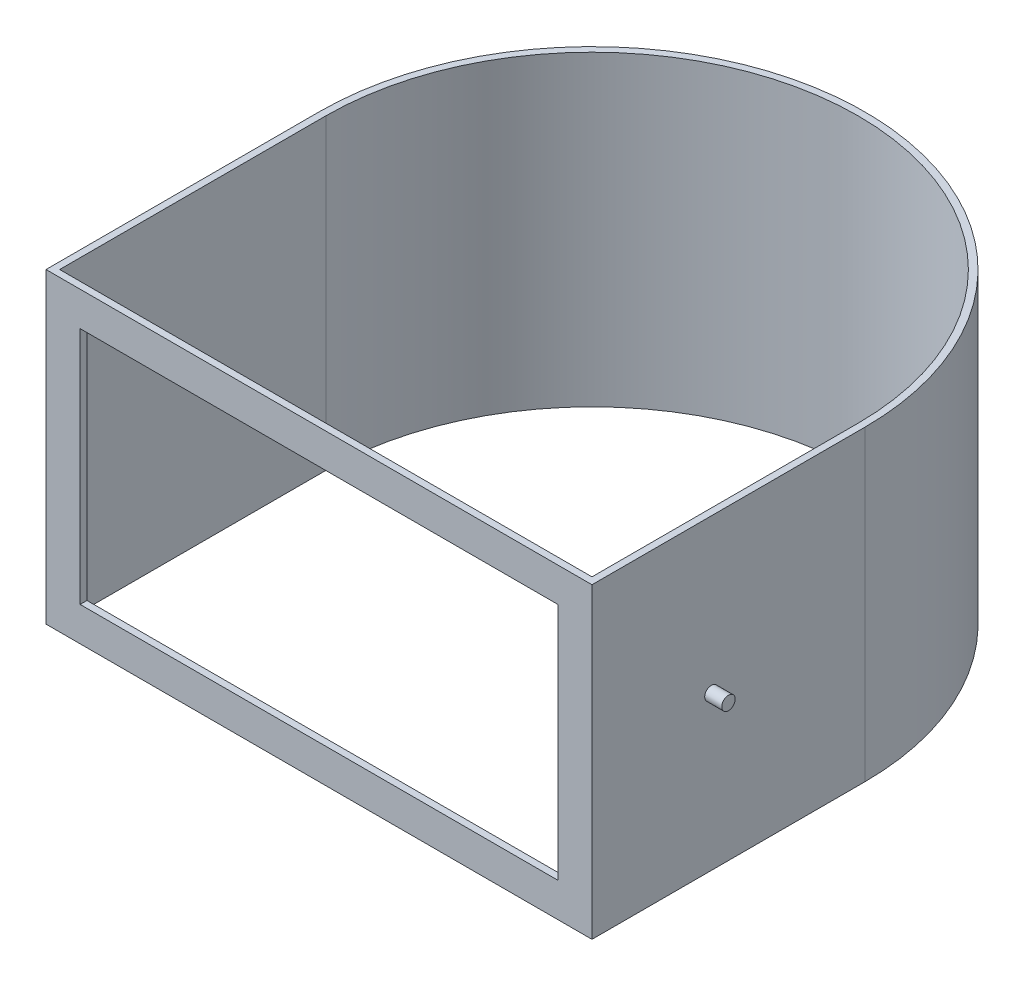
ISO-10303-21;
HEADER;
FILE_DESCRIPTION(('STEP AP214'),'2;1');
FILE_NAME('part.step','',(''),(''),'','','');
FILE_SCHEMA(('AUTOMOTIVE_DESIGN { 1 0 10303 214 1 1 1 1 }'));
ENDSEC;
DATA;
#1=APPLICATION_CONTEXT('core data for automotive mechanical design processes');
#2=APPLICATION_PROTOCOL_DEFINITION('international standard','automotive_design',2000,#1);
#3=PRODUCT_CONTEXT('',#1,'mechanical');
#4=PRODUCT('Part','Part','',(#3));
#5=PRODUCT_RELATED_PRODUCT_CATEGORY('part','',(#4));
#6=PRODUCT_DEFINITION_FORMATION('','',#4);
#7=PRODUCT_DEFINITION_CONTEXT('part definition',#1,'design');
#8=PRODUCT_DEFINITION('design','',#6,#7);
#9=PRODUCT_DEFINITION_SHAPE('','',#8);
#10=(LENGTH_UNIT() NAMED_UNIT(*) SI_UNIT(.MILLI.,.METRE.));
#11=(NAMED_UNIT(*) PLANE_ANGLE_UNIT() SI_UNIT($,.RADIAN.));
#12=(NAMED_UNIT(*) SI_UNIT($,.STERADIAN.) SOLID_ANGLE_UNIT());
#13=UNCERTAINTY_MEASURE_WITH_UNIT(LENGTH_MEASURE(1.E-05),#10,'distance_accuracy_value','');
#14=(GEOMETRIC_REPRESENTATION_CONTEXT(3) GLOBAL_UNCERTAINTY_ASSIGNED_CONTEXT((#13)) GLOBAL_UNIT_ASSIGNED_CONTEXT((#10,
#11,#12)) REPRESENTATION_CONTEXT('',''));
#15=CARTESIAN_POINT('',(0.,0.,0.));
#16=DIRECTION('',(0.,0.,1.));
#17=DIRECTION('',(1.,0.,0.));
#18=AXIS2_PLACEMENT_3D('',#15,#16,#17);
#19=CARTESIAN_POINT('',(0.,114.3,0.));
#20=DIRECTION('',(0.,-1.,0.));
#21=DIRECTION('',(0.,0.,-1.));
#22=AXIS2_PLACEMENT_3D('',#19,#20,#21);
#23=CYLINDRICAL_SURFACE('',#22,101.6);
#24=CARTESIAN_POINT('',(0.,0.,0.));
#25=DIRECTION('',(0.,1.,0.));
#26=DIRECTION('',(0.,0.,1.));
#27=AXIS2_PLACEMENT_3D('',#24,#25,#26);
#28=CIRCLE('',#27,101.6);
#29=CARTESIAN_POINT('',(101.6,0.,0.));
#30=VERTEX_POINT('',#29);
#31=CARTESIAN_POINT('',(-101.6,0.,0.));
#32=VERTEX_POINT('',#31);
#33=EDGE_CURVE('E308',#30,#32,#28,.T.);
#34=ORIENTED_EDGE('',*,*,#33,.T.);
#35=DIRECTION('',(0.,-1.,0.));
#36=VECTOR('',#35,1.);
#37=CARTESIAN_POINT('',(-101.6,114.3,0.));
#38=LINE('',#37,#36);
#39=CARTESIAN_POINT('',(-101.6,114.3,0.));
#40=VERTEX_POINT('',#39);
#41=EDGE_CURVE('E80',#40,#32,#38,.T.);
#42=ORIENTED_EDGE('',*,*,#41,.F.);
#43=CARTESIAN_POINT('',(0.,114.3,0.));
#44=DIRECTION('',(0.,1.,0.));
#45=DIRECTION('',(0.,0.,1.));
#46=AXIS2_PLACEMENT_3D('',#43,#44,#45);
#47=CIRCLE('',#46,101.6);
#48=CARTESIAN_POINT('',(101.6,114.3,0.));
#49=VERTEX_POINT('',#48);
#50=EDGE_CURVE('E337',#49,#40,#47,.T.);
#51=ORIENTED_EDGE('',*,*,#50,.F.);
#52=DIRECTION('',(0.,-1.,0.));
#53=VECTOR('',#52,1.);
#54=CARTESIAN_POINT('',(101.6,114.3,0.));
#55=LINE('',#54,#53);
#56=EDGE_CURVE('E313',#49,#30,#55,.T.);
#57=ORIENTED_EDGE('',*,*,#56,.T.);
#58=EDGE_LOOP('',(#34,#42,#51,#57));
#59=FACE_BOUND('',#58,.T.);
#60=CARTESIAN_POINT('',(2.5,57.15,-101.569237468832));
#61=CARTESIAN_POINT('',(2.49999378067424,57.0095967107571,-101.569237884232));
#62=CARTESIAN_POINT('',(2.48813245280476,56.8690921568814,-101.56953172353));
#63=CARTESIAN_POINT('',(2.4409807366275,56.591954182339,-101.570675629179));
#64=CARTESIAN_POINT('',(2.4056622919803,56.4553256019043,-101.571526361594));
#65=CARTESIAN_POINT('',(2.31260379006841,56.1899946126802,-101.573687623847));
#66=CARTESIAN_POINT('',(2.25487461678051,56.0612883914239,-101.574997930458));
#67=CARTESIAN_POINT('',(2.11864877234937,55.8154301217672,-101.577930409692));
#68=CARTESIAN_POINT('',(2.04015720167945,55.6982752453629,-101.579552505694));
#69=CARTESIAN_POINT('',(1.86460121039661,55.478767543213,-101.582926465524));
#70=CARTESIAN_POINT('',(1.76753134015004,55.3764190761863,-101.584678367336));
#71=CARTESIAN_POINT('',(1.55758293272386,55.1894658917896,-101.588114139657));
#72=CARTESIAN_POINT('',(1.44470376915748,55.1048618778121,-101.589798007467));
#73=CARTESIAN_POINT('',(1.20632850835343,54.9557952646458,-101.592908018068));
#74=CARTESIAN_POINT('',(1.08083104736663,54.8913348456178,-101.594334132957));
#75=CARTESIAN_POINT('',(0.82079141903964,54.7843995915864,-101.596767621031));
#76=CARTESIAN_POINT('',(0.686249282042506,54.7419246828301,-101.597774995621));
#77=CARTESIAN_POINT('',(0.411968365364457,54.6801743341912,-101.59925726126));
#78=CARTESIAN_POINT('',(0.272230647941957,54.6608941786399,-101.599732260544));
#79=CARTESIAN_POINT('',(-0.00849872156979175,54.6460661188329,-101.600096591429));
#80=CARTESIAN_POINT('',(-0.149490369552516,54.6505181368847,-101.599985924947));
#81=CARTESIAN_POINT('',(-0.428693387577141,54.6830240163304,-101.599191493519));
#82=CARTESIAN_POINT('',(-0.56690535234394,54.7110727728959,-101.598507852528));
#83=CARTESIAN_POINT('',(-0.836658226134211,54.7899680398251,-101.596644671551));
#84=CARTESIAN_POINT('',(-0.96819912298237,54.8408145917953,-101.59546513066));
#85=CARTESIAN_POINT('',(-1.22089222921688,54.9638679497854,-101.592742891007));
#86=CARTESIAN_POINT('',(-1.34204329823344,55.0360770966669,-101.59120015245));
#87=CARTESIAN_POINT('',(-1.57050515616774,55.1998041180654,-101.587925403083));
#88=CARTESIAN_POINT('',(-1.67781592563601,55.2913220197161,-101.586193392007));
#89=CARTESIAN_POINT('',(-1.87558079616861,55.4910975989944,-101.582734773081));
#90=CARTESIAN_POINT('',(-1.96603041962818,55.5993597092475,-101.581008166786));
#91=CARTESIAN_POINT('',(-2.12747097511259,55.8295348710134,-101.577755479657));
#92=CARTESIAN_POINT('',(-2.19846190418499,55.9514479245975,-101.576229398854));
#93=CARTESIAN_POINT('',(-2.31896936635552,56.2054667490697,-101.573549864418));
#94=CARTESIAN_POINT('',(-2.368485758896,56.3375725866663,-101.572396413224));
#95=CARTESIAN_POINT('',(-2.44463568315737,56.6082258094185,-101.570592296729));
#96=CARTESIAN_POINT('',(-2.47126925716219,56.7467731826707,-101.5699416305));
#97=CARTESIAN_POINT('',(-2.50089202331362,57.0263376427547,-101.569216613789));
#98=CARTESIAN_POINT('',(-2.50388741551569,57.167354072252,-101.569142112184));
#99=CARTESIAN_POINT('',(-2.48616494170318,57.4478878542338,-101.569577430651));
#100=CARTESIAN_POINT('',(-2.46544709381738,57.5874052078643,-101.570087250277));
#101=CARTESIAN_POINT('',(-2.40089138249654,57.8609631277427,-101.571633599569));
#102=CARTESIAN_POINT('',(-2.35705633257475,57.9950043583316,-101.572670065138));
#103=CARTESIAN_POINT('',(-2.24751340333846,58.2538254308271,-101.575152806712));
#104=CARTESIAN_POINT('',(-2.18180549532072,58.3786052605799,-101.576599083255));
#105=CARTESIAN_POINT('',(-2.03036608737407,58.6153900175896,-101.579738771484));
#106=CARTESIAN_POINT('',(-1.94463041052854,58.7273922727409,-101.581432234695));
#107=CARTESIAN_POINT('',(-1.7555753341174,58.9354156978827,-101.584875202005));
#108=CARTESIAN_POINT('',(-1.6522559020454,59.0314368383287,-101.586624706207));
#109=CARTESIAN_POINT('',(-1.43093966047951,59.2047929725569,-101.589982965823));
#110=CARTESIAN_POINT('',(-1.31293971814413,59.2821239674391,-101.591591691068));
#111=CARTESIAN_POINT('',(-1.06562812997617,59.415877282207,-101.594486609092));
#112=CARTESIAN_POINT('',(-0.936316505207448,59.4722996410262,-101.59577280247));
#113=CARTESIAN_POINT('',(-0.670067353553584,59.5626270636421,-101.597877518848));
#114=CARTESIAN_POINT('',(-0.533130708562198,59.5965347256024,-101.598696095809));
#115=CARTESIAN_POINT('',(-0.2555060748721,59.6408787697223,-101.599773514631));
#116=CARTESIAN_POINT('',(-0.114818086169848,59.6513151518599,-101.600032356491));
#117=CARTESIAN_POINT('',(0.166275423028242,59.6484200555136,-101.599961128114));
#118=CARTESIAN_POINT('',(0.306681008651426,59.6350948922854,-101.599631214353));
#119=CARTESIAN_POINT('',(0.583261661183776,59.5850679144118,-101.598419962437));
#120=CARTESIAN_POINT('',(0.719436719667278,59.5483660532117,-101.597538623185));
#121=CARTESIAN_POINT('',(0.983693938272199,59.4526280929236,-101.595323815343));
#122=CARTESIAN_POINT('',(1.11177595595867,59.3935916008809,-101.593990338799));
#123=CARTESIAN_POINT('',(1.35620716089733,59.2548632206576,-101.591021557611));
#124=CARTESIAN_POINT('',(1.47255678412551,59.1751721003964,-101.589386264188));
#125=CARTESIAN_POINT('',(1.69024750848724,58.9973811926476,-101.585997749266));
#126=CARTESIAN_POINT('',(1.79158621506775,58.8992784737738,-101.584244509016));
#127=CARTESIAN_POINT('',(1.97638253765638,58.6874237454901,-101.58081747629));
#128=CARTESIAN_POINT('',(2.05983571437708,58.5736678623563,-101.579143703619));
#129=CARTESIAN_POINT('',(2.20650174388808,58.3336995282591,-101.576063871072));
#130=CARTESIAN_POINT('',(2.26970258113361,58.207479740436,-101.574657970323));
#131=CARTESIAN_POINT('',(2.37394291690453,57.9463154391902,-101.572275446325));
#132=CARTESIAN_POINT('',(2.41500888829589,57.8113815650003,-101.571298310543));
#133=CARTESIAN_POINT('',(2.4629105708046,57.5879940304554,-101.570145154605));
#134=CARTESIAN_POINT('',(2.47680165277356,57.5009908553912,-101.569806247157));
#135=CARTESIAN_POINT('',(2.49534831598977,57.3260050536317,-101.569352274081));
#136=CARTESIAN_POINT('',(2.50000389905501,57.238022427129,-101.569237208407));
#137=CARTESIAN_POINT('',(2.5,57.15,-101.569237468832));
#138=B_SPLINE_CURVE_WITH_KNOTS('',3,(#60,#61,#62,#63,#64,#65,#66,#67,#68,#69,#70,#71,#72,#73,
#74,#75,#76,#77,#78,#79,#80,#81,#82,#83,#84,#85,#86,#87,#88,#89,#90,#91,#92,#93,#94,#95,#96,#97,
#98,#99,#100,#101,#102,#103,#104,#105,#106,#107,#108,#109,#110,#111,#112,#113,#114,#115,#116,
#117,#118,#119,#120,#121,#122,#123,#124,#125,#126,#127,#128,#129,#130,#131,#132,#133,#134,#135,
#136,#137),.UNSPECIFIED.,.T.,.F.,(4,2,2,2,2,2,2,2,2,2,2,2,2,2,2,2,2,2,2,2,2,2,2,2,2,2,2,2,2,2,2,
2,2,2,2,2,2,2,4),(0.,0.420888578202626,0.842281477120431,1.26346997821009,1.68455510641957,
2.10576394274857,2.5269894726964,2.94826057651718,3.36953026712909,3.79071429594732,
4.21189694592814,4.63298850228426,5.0540808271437,5.47521931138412,5.89635838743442,
6.31760914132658,6.73885995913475,7.16011353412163,7.58136633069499,8.00250863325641,
8.42365061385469,8.84474135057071,9.26583263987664,9.68701182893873,10.1081917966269,
10.5294617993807,10.9507310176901,11.3719516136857,11.7931722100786,12.2142808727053,
12.6353903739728,13.0565072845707,13.4776085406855,13.8987768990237,14.320049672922,
14.7415719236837,15.162588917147,15.4264548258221,15.6903206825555),.UNSPECIFIED.);
#139=CARTESIAN_POINT('',(2.5,57.15,-101.569237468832));
#140=VERTEX_POINT('',#139);
#141=EDGE_CURVE('E12',#140,#140,#138,.T.);
#142=ORIENTED_EDGE('',*,*,#141,.F.);
#143=EDGE_LOOP('',(#142));
#144=FACE_BOUND('',#143,.T.);
#145=ADVANCED_FACE('F76',(#59,#144),#23,.T.);
#146=CARTESIAN_POINT('',(0.,114.3,0.));
#147=DIRECTION('',(0.,-1.,0.));
#148=DIRECTION('',(0.,0.,-1.));
#149=AXIS2_PLACEMENT_3D('',#146,#147,#148);
#150=CYLINDRICAL_SURFACE('',#149,99.06);
#151=DIRECTION('',(0.,1.,0.));
#152=VECTOR('',#151,1.);
#153=CARTESIAN_POINT('',(-99.06,114.3,0.));
#154=LINE('',#153,#152);
#155=CARTESIAN_POINT('',(-99.06,114.3,0.));
#156=VERTEX_POINT('',#155);
#157=CARTESIAN_POINT('',(-99.06,0.,0.));
#158=VERTEX_POINT('',#157);
#159=EDGE_CURVE('E319',#156,#158,#154,.F.);
#160=ORIENTED_EDGE('',*,*,#159,.T.);
#161=CARTESIAN_POINT('',(0.,0.,0.));
#162=DIRECTION('',(0.,1.,0.));
#163=DIRECTION('',(0.,0.,1.));
#164=AXIS2_PLACEMENT_3D('',#161,#162,#163);
#165=CIRCLE('',#164,99.06);
#166=CARTESIAN_POINT('',(99.06,0.,0.));
#167=VERTEX_POINT('',#166);
#168=EDGE_CURVE('E217',#167,#158,#165,.T.);
#169=ORIENTED_EDGE('',*,*,#168,.F.);
#170=DIRECTION('',(0.,-1.,0.));
#171=VECTOR('',#170,1.);
#172=CARTESIAN_POINT('',(99.06,114.3,0.));
#173=LINE('',#172,#171);
#174=CARTESIAN_POINT('',(99.06,114.3,0.));
#175=VERTEX_POINT('',#174);
#176=EDGE_CURVE('E360',#175,#167,#173,.T.);
#177=ORIENTED_EDGE('',*,*,#176,.F.);
#178=CARTESIAN_POINT('',(0.,114.3,0.));
#179=DIRECTION('',(0.,1.,0.));
#180=DIRECTION('',(0.,0.,1.));
#181=AXIS2_PLACEMENT_3D('',#178,#179,#180);
#182=CIRCLE('',#181,99.06);
#183=EDGE_CURVE('E358',#175,#156,#182,.T.);
#184=ORIENTED_EDGE('',*,*,#183,.T.);
#185=EDGE_LOOP('',(#160,#169,#177,#184));
#186=FACE_BOUND('',#185,.T.);
#187=ADVANCED_FACE('F264',(#186),#150,.F.);
#188=CARTESIAN_POINT('',(-101.6,114.3,0.));
#189=DIRECTION('',(1.,0.,0.));
#190=DIRECTION('',(0.,0.,-1.));
#191=AXIS2_PLACEMENT_3D('',#188,#189,#190);
#192=PLANE('',#191);
#193=CARTESIAN_POINT('',(-101.6,57.15,57.15));
#194=DIRECTION('',(1.,0.,0.));
#195=DIRECTION('',(0.,0.,-1.));
#196=AXIS2_PLACEMENT_3D('',#193,#194,#195);
#197=CIRCLE('',#196,2.5);
#198=CARTESIAN_POINT('',(-101.6,57.15,54.65));
#199=VERTEX_POINT('',#198);
#200=EDGE_CURVE('E356',#199,#199,#197,.T.);
#201=ORIENTED_EDGE('',*,*,#200,.T.);
#202=EDGE_LOOP('',(#201));
#203=FACE_BOUND('',#202,.T.);
#204=DIRECTION('',(0.,0.,1.));
#205=VECTOR('',#204,1.);
#206=CARTESIAN_POINT('',(-101.6,0.,0.));
#207=LINE('',#206,#205);
#208=CARTESIAN_POINT('',(-101.6,0.,101.6));
#209=VERTEX_POINT('',#208);
#210=EDGE_CURVE('E318',#32,#209,#207,.T.);
#211=ORIENTED_EDGE('',*,*,#210,.T.);
#212=DIRECTION('',(0.,-1.,0.));
#213=VECTOR('',#212,1.);
#214=CARTESIAN_POINT('',(-101.6,114.3,101.6));
#215=LINE('',#214,#213);
#216=CARTESIAN_POINT('',(-101.6,114.3,101.6));
#217=VERTEX_POINT('',#216);
#218=EDGE_CURVE('E342',#217,#209,#215,.T.);
#219=ORIENTED_EDGE('',*,*,#218,.F.);
#220=DIRECTION('',(0.,0.,1.));
#221=VECTOR('',#220,1.);
#222=CARTESIAN_POINT('',(-101.6,114.3,0.));
#223=LINE('',#222,#221);
#224=EDGE_CURVE('E384',#40,#217,#223,.T.);
#225=ORIENTED_EDGE('',*,*,#224,.F.);
#226=ORIENTED_EDGE('',*,*,#41,.T.);
#227=EDGE_LOOP('',(#211,#219,#225,#226));
#228=FACE_BOUND('',#227,.T.);
#229=ADVANCED_FACE('F267',(#203,#228),#192,.F.);
#230=CARTESIAN_POINT('',(0.,114.3,101.6));
#231=DIRECTION('',(0.,0.,-1.));
#232=DIRECTION('',(-1.,0.,0.));
#233=AXIS2_PLACEMENT_3D('',#230,#231,#232);
#234=PLANE('',#233);
#235=DIRECTION('',(-1.,0.,0.));
#236=VECTOR('',#235,1.);
#237=CARTESIAN_POINT('',(-88.9,101.6,101.6));
#238=LINE('',#237,#236);
#239=CARTESIAN_POINT('',(88.9,101.6,101.6));
#240=VERTEX_POINT('',#239);
#241=CARTESIAN_POINT('',(-88.9,101.6,101.6));
#242=VERTEX_POINT('',#241);
#243=EDGE_CURVE('E202',#240,#242,#238,.T.);
#244=ORIENTED_EDGE('',*,*,#243,.F.);
#245=DIRECTION('',(0.,1.,0.));
#246=VECTOR('',#245,1.);
#247=CARTESIAN_POINT('',(88.9,12.7,101.6));
#248=LINE('',#247,#246);
#249=CARTESIAN_POINT('',(88.9,12.7,101.6));
#250=VERTEX_POINT('',#249);
#251=EDGE_CURVE('E94',#250,#240,#248,.T.);
#252=ORIENTED_EDGE('',*,*,#251,.F.);
#253=DIRECTION('',(1.,0.,0.));
#254=VECTOR('',#253,1.);
#255=CARTESIAN_POINT('',(-88.9,12.7,101.6));
#256=LINE('',#255,#254);
#257=CARTESIAN_POINT('',(-88.9,12.7,101.6));
#258=VERTEX_POINT('',#257);
#259=EDGE_CURVE('E189',#258,#250,#256,.T.);
#260=ORIENTED_EDGE('',*,*,#259,.F.);
#261=DIRECTION('',(0.,-1.,0.));
#262=VECTOR('',#261,1.);
#263=CARTESIAN_POINT('',(-88.9,12.7,101.6));
#264=LINE('',#263,#262);
#265=EDGE_CURVE('E193',#242,#258,#264,.T.);
#266=ORIENTED_EDGE('',*,*,#265,.F.);
#267=EDGE_LOOP('',(#244,#252,#260,#266));
#268=FACE_BOUND('',#267,.T.);
#269=DIRECTION('',(1.,0.,0.));
#270=VECTOR('',#269,1.);
#271=CARTESIAN_POINT('',(0.,0.,101.6));
#272=LINE('',#271,#270);
#273=CARTESIAN_POINT('',(101.6,0.,101.6));
#274=VERTEX_POINT('',#273);
#275=EDGE_CURVE('E323',#209,#274,#272,.T.);
#276=ORIENTED_EDGE('',*,*,#275,.T.);
#277=DIRECTION('',(0.,-1.,0.));
#278=VECTOR('',#277,1.);
#279=CARTESIAN_POINT('',(101.6,114.3,101.6));
#280=LINE('',#279,#278);
#281=CARTESIAN_POINT('',(101.6,114.3,101.6));
#282=VERTEX_POINT('',#281);
#283=EDGE_CURVE('E340',#282,#274,#280,.T.);
#284=ORIENTED_EDGE('',*,*,#283,.F.);
#285=DIRECTION('',(1.,0.,0.));
#286=VECTOR('',#285,1.);
#287=CARTESIAN_POINT('',(0.,114.3,101.6));
#288=LINE('',#287,#286);
#289=EDGE_CURVE('E386',#217,#282,#288,.T.);
#290=ORIENTED_EDGE('',*,*,#289,.F.);
#291=ORIENTED_EDGE('',*,*,#218,.T.);
#292=EDGE_LOOP('',(#276,#284,#290,#291));
#293=FACE_BOUND('',#292,.T.);
#294=ADVANCED_FACE('F289',(#268,#293),#234,.F.);
#295=CARTESIAN_POINT('',(101.6,114.3,0.));
#296=DIRECTION('',(1.,0.,0.));
#297=DIRECTION('',(0.,0.,-1.));
#298=AXIS2_PLACEMENT_3D('',#295,#296,#297);
#299=PLANE('',#298);
#300=CARTESIAN_POINT('',(101.6,57.15,57.15));
#301=DIRECTION('',(1.,0.,0.));
#302=DIRECTION('',(0.,0.,-1.));
#303=AXIS2_PLACEMENT_3D('',#300,#301,#302);
#304=CIRCLE('',#303,2.5);
#305=CARTESIAN_POINT('',(101.6,57.15,54.65));
#306=VERTEX_POINT('',#305);
#307=EDGE_CURVE('E86',#306,#306,#304,.T.);
#308=ORIENTED_EDGE('',*,*,#307,.F.);
#309=EDGE_LOOP('',(#308));
#310=FACE_BOUND('',#309,.T.);
#311=DIRECTION('',(0.,0.,1.));
#312=VECTOR('',#311,1.);
#313=CARTESIAN_POINT('',(101.6,0.,0.));
#314=LINE('',#313,#312);
#315=EDGE_CURVE('E334',#30,#274,#314,.T.);
#316=ORIENTED_EDGE('',*,*,#315,.F.);
#317=ORIENTED_EDGE('',*,*,#56,.F.);
#318=DIRECTION('',(0.,0.,1.));
#319=VECTOR('',#318,1.);
#320=CARTESIAN_POINT('',(101.6,114.3,0.));
#321=LINE('',#320,#319);
#322=EDGE_CURVE('E328',#49,#282,#321,.T.);
#323=ORIENTED_EDGE('',*,*,#322,.T.);
#324=ORIENTED_EDGE('',*,*,#283,.T.);
#325=EDGE_LOOP('',(#316,#317,#323,#324));
#326=FACE_BOUND('',#325,.T.);
#327=ADVANCED_FACE('F282',(#310,#326),#299,.T.);
#328=CARTESIAN_POINT('',(0.,114.3,0.));
#329=DIRECTION('',(0.,1.,0.));
#330=DIRECTION('',(0.,0.,1.));
#331=AXIS2_PLACEMENT_3D('',#328,#329,#330);
#332=PLANE('',#331);
#333=ORIENTED_EDGE('',*,*,#183,.F.);
#334=DIRECTION('',(0.,0.,1.));
#335=VECTOR('',#334,1.);
#336=CARTESIAN_POINT('',(99.06,114.3,0.));
#337=LINE('',#336,#335);
#338=CARTESIAN_POINT('',(99.06,114.3,99.06));
#339=VERTEX_POINT('',#338);
#340=EDGE_CURVE('E364',#175,#339,#337,.T.);
#341=ORIENTED_EDGE('',*,*,#340,.T.);
#342=DIRECTION('',(1.,0.,0.));
#343=VECTOR('',#342,1.);
#344=CARTESIAN_POINT('',(0.,114.3,99.06));
#345=LINE('',#344,#343);
#346=CARTESIAN_POINT('',(-99.06,114.3,99.06));
#347=VERTEX_POINT('',#346);
#348=EDGE_CURVE('E374',#347,#339,#345,.T.);
#349=ORIENTED_EDGE('',*,*,#348,.F.);
#350=DIRECTION('',(0.,0.,1.));
#351=VECTOR('',#350,1.);
#352=CARTESIAN_POINT('',(-99.06,114.3,0.));
#353=LINE('',#352,#351);
#354=EDGE_CURVE('E371',#156,#347,#353,.T.);
#355=ORIENTED_EDGE('',*,*,#354,.F.);
#356=EDGE_LOOP('',(#333,#341,#349,#355));
#357=FACE_BOUND('',#356,.T.);
#358=ORIENTED_EDGE('',*,*,#50,.T.);
#359=ORIENTED_EDGE('',*,*,#224,.T.);
#360=ORIENTED_EDGE('',*,*,#289,.T.);
#361=ORIENTED_EDGE('',*,*,#322,.F.);
#362=EDGE_LOOP('',(#358,#359,#360,#361));
#363=FACE_BOUND('',#362,.T.);
#364=ADVANCED_FACE('F279',(#357,#363),#332,.T.);
#365=CARTESIAN_POINT('',(0.,0.,0.));
#366=DIRECTION('',(0.,1.,0.));
#367=DIRECTION('',(0.,0.,1.));
#368=AXIS2_PLACEMENT_3D('',#365,#366,#367);
#369=PLANE('',#368);
#370=DIRECTION('',(0.,0.,-1.));
#371=VECTOR('',#370,1.);
#372=CARTESIAN_POINT('',(99.06,0.,99.06));
#373=LINE('',#372,#371);
#374=CARTESIAN_POINT('',(99.06,0.,99.06));
#375=VERTEX_POINT('',#374);
#376=EDGE_CURVE('E211',#375,#167,#373,.T.);
#377=ORIENTED_EDGE('',*,*,#376,.T.);
#378=ORIENTED_EDGE('',*,*,#168,.T.);
#379=DIRECTION('',(0.,0.,-1.));
#380=VECTOR('',#379,1.);
#381=CARTESIAN_POINT('',(-99.06,0.,99.06));
#382=LINE('',#381,#380);
#383=CARTESIAN_POINT('',(-99.06,0.,99.06));
#384=VERTEX_POINT('',#383);
#385=EDGE_CURVE('E222',#384,#158,#382,.T.);
#386=ORIENTED_EDGE('',*,*,#385,.F.);
#387=DIRECTION('',(1.,0.,0.));
#388=VECTOR('',#387,1.);
#389=CARTESIAN_POINT('',(-99.06,0.,99.06));
#390=LINE('',#389,#388);
#391=EDGE_CURVE('E226',#384,#375,#390,.T.);
#392=ORIENTED_EDGE('',*,*,#391,.T.);
#393=EDGE_LOOP('',(#377,#378,#386,#392));
#394=FACE_BOUND('',#393,.T.);
#395=ORIENTED_EDGE('',*,*,#33,.F.);
#396=ORIENTED_EDGE('',*,*,#315,.T.);
#397=ORIENTED_EDGE('',*,*,#275,.F.);
#398=ORIENTED_EDGE('',*,*,#210,.F.);
#399=EDGE_LOOP('',(#395,#396,#397,#398));
#400=FACE_BOUND('',#399,.T.);
#401=ADVANCED_FACE('F272',(#394,#400),#369,.F.);
#402=CARTESIAN_POINT('',(-99.06,114.3,0.));
#403=DIRECTION('',(1.,0.,0.));
#404=DIRECTION('',(0.,0.,-1.));
#405=AXIS2_PLACEMENT_3D('',#402,#403,#404);
#406=PLANE('',#405);
#407=DIRECTION('',(0.,-1.,0.));
#408=VECTOR('',#407,1.);
#409=CARTESIAN_POINT('',(-99.06,114.3,99.06));
#410=LINE('',#409,#408);
#411=EDGE_CURVE('E325',#347,#384,#410,.T.);
#412=ORIENTED_EDGE('',*,*,#411,.T.);
#413=ORIENTED_EDGE('',*,*,#385,.T.);
#414=ORIENTED_EDGE('',*,*,#159,.F.);
#415=ORIENTED_EDGE('',*,*,#354,.T.);
#416=EDGE_LOOP('',(#412,#413,#414,#415));
#417=FACE_BOUND('',#416,.T.);
#418=ADVANCED_FACE('F269',(#417),#406,.T.);
#419=CARTESIAN_POINT('',(0.,114.3,99.06));
#420=DIRECTION('',(0.,0.,-1.));
#421=DIRECTION('',(-1.,0.,0.));
#422=AXIS2_PLACEMENT_3D('',#419,#420,#421);
#423=PLANE('',#422);
#424=DIRECTION('',(0.,1.,0.));
#425=VECTOR('',#424,1.);
#426=CARTESIAN_POINT('',(88.9,12.7,99.06));
#427=LINE('',#426,#425);
#428=CARTESIAN_POINT('',(88.9,12.7,99.06));
#429=VERTEX_POINT('',#428);
#430=CARTESIAN_POINT('',(88.9,101.6,99.06));
#431=VERTEX_POINT('',#430);
#432=EDGE_CURVE('E170',#429,#431,#427,.T.);
#433=ORIENTED_EDGE('',*,*,#432,.T.);
#434=DIRECTION('',(-1.,0.,0.));
#435=VECTOR('',#434,1.);
#436=CARTESIAN_POINT('',(-88.9,101.6,99.06));
#437=LINE('',#436,#435);
#438=CARTESIAN_POINT('',(-88.9,101.6,99.06));
#439=VERTEX_POINT('',#438);
#440=EDGE_CURVE('E180',#431,#439,#437,.T.);
#441=ORIENTED_EDGE('',*,*,#440,.T.);
#442=DIRECTION('',(0.,-1.,0.));
#443=VECTOR('',#442,1.);
#444=CARTESIAN_POINT('',(-88.9,12.7,99.06));
#445=LINE('',#444,#443);
#446=CARTESIAN_POINT('',(-88.9,12.7,99.06));
#447=VERTEX_POINT('',#446);
#448=EDGE_CURVE('E102',#439,#447,#445,.T.);
#449=ORIENTED_EDGE('',*,*,#448,.T.);
#450=DIRECTION('',(1.,0.,0.));
#451=VECTOR('',#450,1.);
#452=CARTESIAN_POINT('',(-88.9,12.7,99.06));
#453=LINE('',#452,#451);
#454=EDGE_CURVE('E177',#447,#429,#453,.T.);
#455=ORIENTED_EDGE('',*,*,#454,.T.);
#456=EDGE_LOOP('',(#433,#441,#449,#455));
#457=FACE_BOUND('',#456,.T.);
#458=DIRECTION('',(0.,-1.,0.));
#459=VECTOR('',#458,1.);
#460=CARTESIAN_POINT('',(99.06,114.3,99.06));
#461=LINE('',#460,#459);
#462=EDGE_CURVE('E363',#339,#375,#461,.T.);
#463=ORIENTED_EDGE('',*,*,#462,.T.);
#464=ORIENTED_EDGE('',*,*,#391,.F.);
#465=ORIENTED_EDGE('',*,*,#411,.F.);
#466=ORIENTED_EDGE('',*,*,#348,.T.);
#467=EDGE_LOOP('',(#463,#464,#465,#466));
#468=FACE_BOUND('',#467,.T.);
#469=ADVANCED_FACE('F185',(#457,#468),#423,.T.);
#470=CARTESIAN_POINT('',(99.06,114.3,0.));
#471=DIRECTION('',(1.,0.,0.));
#472=DIRECTION('',(0.,0.,-1.));
#473=AXIS2_PLACEMENT_3D('',#470,#471,#472);
#474=PLANE('',#473);
#475=ORIENTED_EDGE('',*,*,#176,.T.);
#476=ORIENTED_EDGE('',*,*,#376,.F.);
#477=ORIENTED_EDGE('',*,*,#462,.F.);
#478=ORIENTED_EDGE('',*,*,#340,.F.);
#479=EDGE_LOOP('',(#475,#476,#477,#478));
#480=FACE_BOUND('',#479,.T.);
#481=ADVANCED_FACE('F255',(#480),#474,.F.);
#482=CARTESIAN_POINT('',(107.95,57.15,57.15));
#483=DIRECTION('',(1.,0.,0.));
#484=DIRECTION('',(0.,0.,-1.));
#485=AXIS2_PLACEMENT_3D('',#482,#483,#484);
#486=PLANE('',#485);
#487=CARTESIAN_POINT('',(107.95,57.15,57.15));
#488=DIRECTION('',(1.,0.,0.));
#489=DIRECTION('',(0.,0.,-1.));
#490=AXIS2_PLACEMENT_3D('',#487,#488,#489);
#491=CIRCLE('',#490,2.5);
#492=CARTESIAN_POINT('',(107.95,57.15,54.65));
#493=VERTEX_POINT('',#492);
#494=EDGE_CURVE('E235',#493,#493,#491,.T.);
#495=ORIENTED_EDGE('',*,*,#494,.T.);
#496=EDGE_LOOP('',(#495));
#497=FACE_BOUND('',#496,.T.);
#498=ADVANCED_FACE('F251',(#497),#486,.T.);
#499=CARTESIAN_POINT('',(-107.95,57.15,57.15));
#500=DIRECTION('',(1.,0.,0.));
#501=DIRECTION('',(0.,0.,-1.));
#502=AXIS2_PLACEMENT_3D('',#499,#500,#501);
#503=CYLINDRICAL_SURFACE('',#502,2.5);
#504=ORIENTED_EDGE('',*,*,#307,.T.);
#505=EDGE_LOOP('',(#504));
#506=FACE_BOUND('',#505,.T.);
#507=ORIENTED_EDGE('',*,*,#494,.F.);
#508=EDGE_LOOP('',(#507));
#509=FACE_BOUND('',#508,.T.);
#510=ADVANCED_FACE('F254',(#506,#509),#503,.T.);
#511=CARTESIAN_POINT('',(-107.95,57.15,57.15));
#512=DIRECTION('',(1.,0.,0.));
#513=DIRECTION('',(0.,0.,-1.));
#514=AXIS2_PLACEMENT_3D('',#511,#512,#513);
#515=CIRCLE('',#514,2.5);
#516=CARTESIAN_POINT('',(-107.95,57.15,54.65));
#517=VERTEX_POINT('',#516);
#518=EDGE_CURVE('E355',#517,#517,#515,.T.);
#519=ORIENTED_EDGE('',*,*,#518,.T.);
#520=EDGE_LOOP('',(#519));
#521=FACE_BOUND('',#520,.T.);
#522=ORIENTED_EDGE('',*,*,#200,.F.);
#523=EDGE_LOOP('',(#522));
#524=FACE_BOUND('',#523,.T.);
#525=ADVANCED_FACE('F259',(#521,#524),#503,.T.);
#526=CARTESIAN_POINT('',(-107.95,57.15,57.15));
#527=DIRECTION('',(1.,0.,0.));
#528=DIRECTION('',(0.,0.,-1.));
#529=AXIS2_PLACEMENT_3D('',#526,#527,#528);
#530=PLANE('',#529);
#531=ORIENTED_EDGE('',*,*,#518,.F.);
#532=EDGE_LOOP('',(#531));
#533=FACE_BOUND('',#532,.T.);
#534=ADVANCED_FACE('F248',(#533),#530,.F.);
#535=CARTESIAN_POINT('',(0.,57.15,-107.95));
#536=DIRECTION('',(0.,0.,1.));
#537=DIRECTION('',(1.,0.,0.));
#538=AXIS2_PLACEMENT_3D('',#535,#536,#537);
#539=CYLINDRICAL_SURFACE('',#538,2.5);
#540=CARTESIAN_POINT('',(0.,57.15,-107.95));
#541=DIRECTION('',(0.,0.,-1.));
#542=DIRECTION('',(-1.,0.,0.));
#543=AXIS2_PLACEMENT_3D('',#540,#541,#542);
#544=CIRCLE('',#543,2.5);
#545=CARTESIAN_POINT('',(-2.5,57.15,-107.95));
#546=VERTEX_POINT('',#545);
#547=EDGE_CURVE('E221',#546,#546,#544,.T.);
#548=ORIENTED_EDGE('',*,*,#547,.F.);
#549=EDGE_LOOP('',(#548));
#550=FACE_BOUND('',#549,.T.);
#551=ORIENTED_EDGE('',*,*,#141,.T.);
#552=EDGE_LOOP('',(#551));
#553=FACE_BOUND('',#552,.T.);
#554=ADVANCED_FACE('F242',(#550,#553),#539,.T.);
#555=CARTESIAN_POINT('',(0.,57.15,-107.95));
#556=DIRECTION('',(0.,0.,-1.));
#557=DIRECTION('',(-1.,0.,0.));
#558=AXIS2_PLACEMENT_3D('',#555,#556,#557);
#559=PLANE('',#558);
#560=ORIENTED_EDGE('',*,*,#547,.T.);
#561=EDGE_LOOP('',(#560));
#562=FACE_BOUND('',#561,.T.);
#563=ADVANCED_FACE('F247',(#562),#559,.T.);
#564=CARTESIAN_POINT('',(88.9,12.7,99.06));
#565=DIRECTION('',(1.,0.,0.));
#566=DIRECTION('',(0.,0.,-1.));
#567=AXIS2_PLACEMENT_3D('',#564,#565,#566);
#568=PLANE('',#567);
#569=ORIENTED_EDGE('',*,*,#251,.T.);
#570=DIRECTION('',(0.,0.,1.));
#571=VECTOR('',#570,1.);
#572=CARTESIAN_POINT('',(88.9,101.6,99.06));
#573=LINE('',#572,#571);
#574=EDGE_CURVE('E166',#431,#240,#573,.T.);
#575=ORIENTED_EDGE('',*,*,#574,.F.);
#576=ORIENTED_EDGE('',*,*,#432,.F.);
#577=DIRECTION('',(0.,0.,1.));
#578=VECTOR('',#577,1.);
#579=CARTESIAN_POINT('',(88.9,12.7,99.06));
#580=LINE('',#579,#578);
#581=EDGE_CURVE('E208',#429,#250,#580,.T.);
#582=ORIENTED_EDGE('',*,*,#581,.T.);
#583=EDGE_LOOP('',(#569,#575,#576,#582));
#584=FACE_BOUND('',#583,.T.);
#585=ADVANCED_FACE('F168',(#584),#568,.F.);
#586=CARTESIAN_POINT('',(-88.9,12.7,99.06));
#587=DIRECTION('',(0.,-1.,0.));
#588=DIRECTION('',(0.,0.,-1.));
#589=AXIS2_PLACEMENT_3D('',#586,#587,#588);
#590=PLANE('',#589);
#591=ORIENTED_EDGE('',*,*,#259,.T.);
#592=ORIENTED_EDGE('',*,*,#581,.F.);
#593=ORIENTED_EDGE('',*,*,#454,.F.);
#594=DIRECTION('',(0.,0.,1.));
#595=VECTOR('',#594,1.);
#596=CARTESIAN_POINT('',(-88.9,12.7,99.06));
#597=LINE('',#596,#595);
#598=EDGE_CURVE('E212',#447,#258,#597,.T.);
#599=ORIENTED_EDGE('',*,*,#598,.T.);
#600=EDGE_LOOP('',(#591,#592,#593,#599));
#601=FACE_BOUND('',#600,.T.);
#602=ADVANCED_FACE('F439',(#601),#590,.F.);
#603=CARTESIAN_POINT('',(-88.9,12.7,99.06));
#604=DIRECTION('',(-1.,0.,0.));
#605=DIRECTION('',(0.,0.,1.));
#606=AXIS2_PLACEMENT_3D('',#603,#604,#605);
#607=PLANE('',#606);
#608=ORIENTED_EDGE('',*,*,#265,.T.);
#609=ORIENTED_EDGE('',*,*,#598,.F.);
#610=ORIENTED_EDGE('',*,*,#448,.F.);
#611=DIRECTION('',(0.,0.,1.));
#612=VECTOR('',#611,1.);
#613=CARTESIAN_POINT('',(-88.9,101.6,99.06));
#614=LINE('',#613,#612);
#615=EDGE_CURVE('E176',#439,#242,#614,.T.);
#616=ORIENTED_EDGE('',*,*,#615,.T.);
#617=EDGE_LOOP('',(#608,#609,#610,#616));
#618=FACE_BOUND('',#617,.T.);
#619=ADVANCED_FACE('F445',(#618),#607,.F.);
#620=CARTESIAN_POINT('',(-88.9,101.6,99.06));
#621=DIRECTION('',(0.,1.,0.));
#622=DIRECTION('',(0.,0.,1.));
#623=AXIS2_PLACEMENT_3D('',#620,#621,#622);
#624=PLANE('',#623);
#625=ORIENTED_EDGE('',*,*,#243,.T.);
#626=ORIENTED_EDGE('',*,*,#615,.F.);
#627=ORIENTED_EDGE('',*,*,#440,.F.);
#628=ORIENTED_EDGE('',*,*,#574,.T.);
#629=EDGE_LOOP('',(#625,#626,#627,#628));
#630=FACE_BOUND('',#629,.T.);
#631=ADVANCED_FACE('F181',(#630),#624,.F.);
#632=CLOSED_SHELL('',(#145,#187,#229,#294,#327,#364,#401,#418,#469,#481,#498,#510,#525,#534,
#554,#563,#585,#602,#619,#631));
#633=MANIFOLD_SOLID_BREP('B2',#632);
#634=ADVANCED_BREP_SHAPE_REPRESENTATION('',(#18,#633),#14);
#635=SHAPE_DEFINITION_REPRESENTATION(#9,#634);
ENDSEC;
END-ISO-10303-21;
